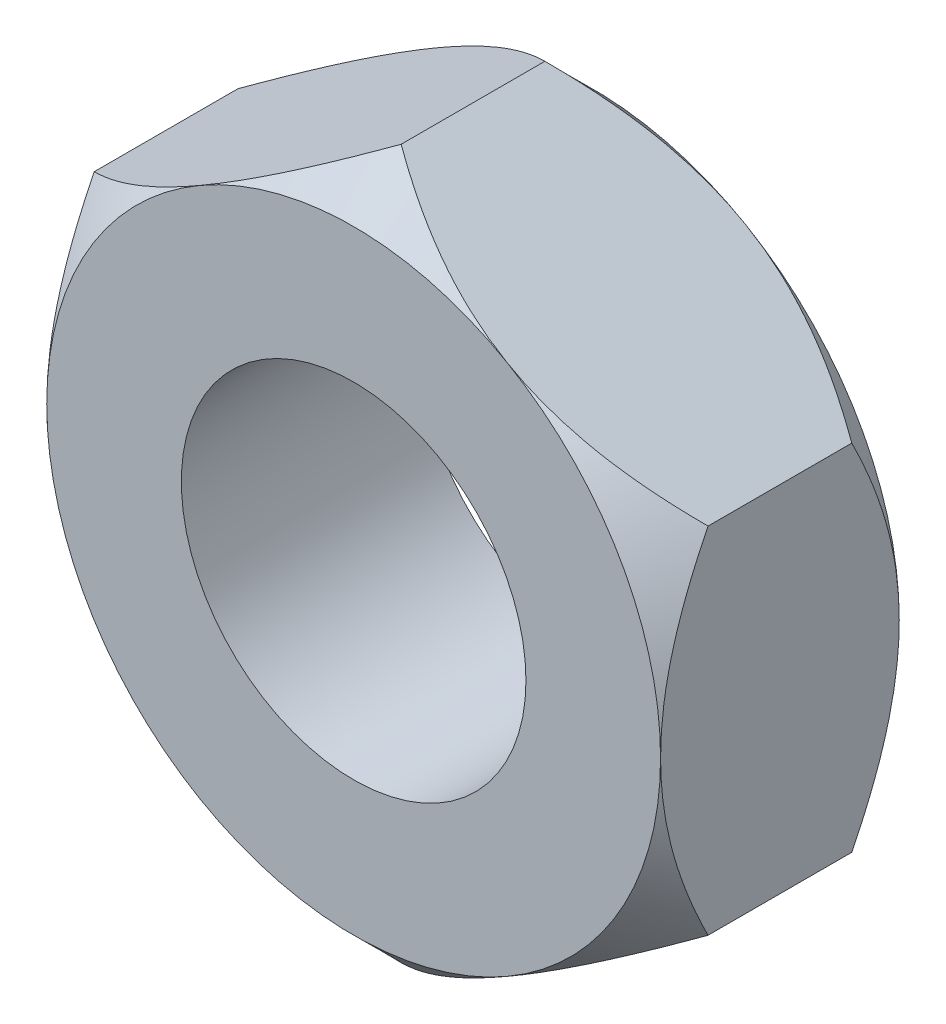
from build123d import *

# Parameters (mm, degrees)
BASE_EXTRUDE_DEPTH = 3.5
SKETCH4_R          = 5.053
CUT_EXTRUDE1_DEPTH = 16.427248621


with BuildPart() as part:
    # Sketch1 → Base-Extrude (new, symmetric)
    with BuildSketch(Plane.XY):
        Polygon((9, 5.196152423), (9, -5.196152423), (0, -10.392304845), (-9, -5.196152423), (-9, 5.196152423), (0, 10.392304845), align=None)
    extrude(amount=BASE_EXTRUDE_DEPTH, both=True)

    # Sketch3 → Cut-Revolve1 (revolve, cut)
    with BuildSketch(Plane(origin=(0, 0, 0), x_dir=(1, 0, 0), z_dir=(0, 1, 0))):
        Polygon((-10.392304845, 3.5), (-9, 3.5), (-10.392304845, 2.107695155), align=None)
    cut_revolve1 = revolve(axis=Axis((0, 0, -3.5), (0, 0, 1)), mode=Mode.SUBTRACT)

    # Mirror1: Cut-Revolve1 across plane
    add(cut_revolve1.mirror(Plane.XY), mode=Mode.SUBTRACT)

    # Sketch4 → Cut-Extrude1 (cut, through all)
    with BuildSketch(Plane.XY.offset(3.5)):
        Circle(SKETCH4_R)
    extrude(amount=-CUT_EXTRUDE1_DEPTH, mode=Mode.SUBTRACT)


solid = part.part
